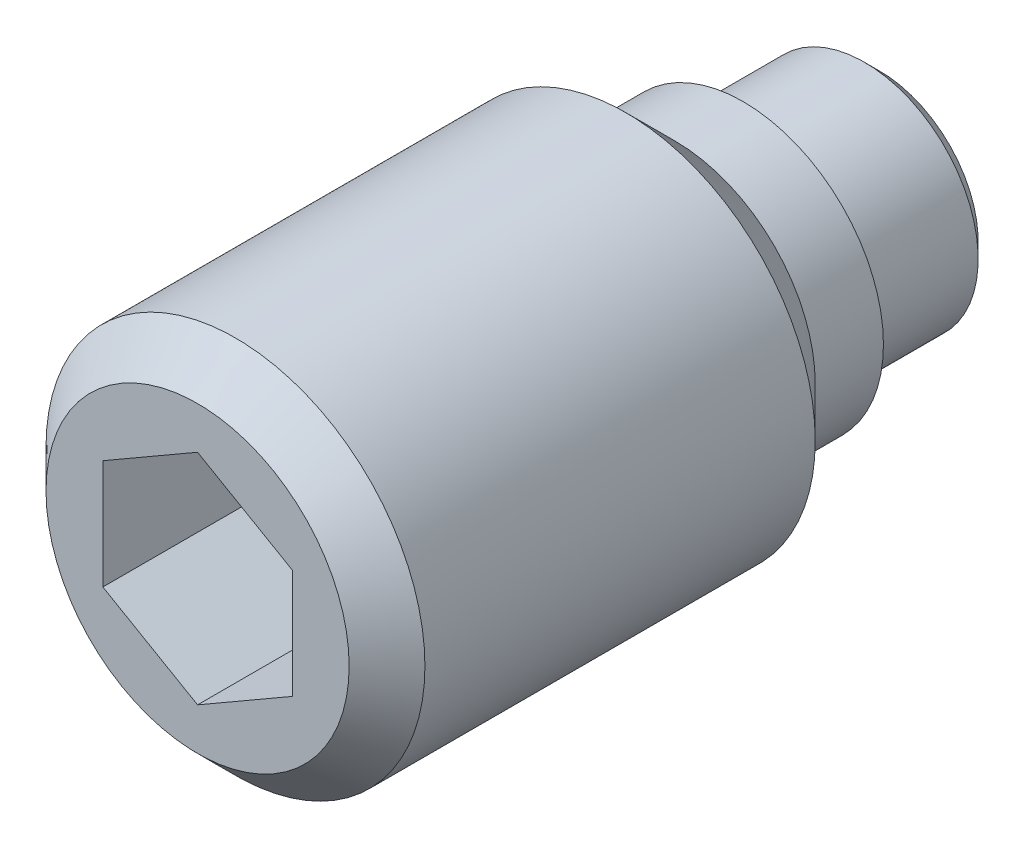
ISO-10303-21;
HEADER;
FILE_DESCRIPTION(('STEP AP214'),'2;1');
FILE_NAME('part.step','',(''),(''),'','','');
FILE_SCHEMA(('AUTOMOTIVE_DESIGN { 1 0 10303 214 1 1 1 1 }'));
ENDSEC;
DATA;
#1=APPLICATION_CONTEXT('core data for automotive mechanical design processes');
#2=APPLICATION_PROTOCOL_DEFINITION('international standard','automotive_design',2000,#1);
#3=PRODUCT_CONTEXT('',#1,'mechanical');
#4=PRODUCT('Part','Part','',(#3));
#5=PRODUCT_RELATED_PRODUCT_CATEGORY('part','',(#4));
#6=PRODUCT_DEFINITION_FORMATION('','',#4);
#7=PRODUCT_DEFINITION_CONTEXT('part definition',#1,'design');
#8=PRODUCT_DEFINITION('design','',#6,#7);
#9=PRODUCT_DEFINITION_SHAPE('','',#8);
#10=(LENGTH_UNIT() NAMED_UNIT(*) SI_UNIT(.MILLI.,.METRE.));
#11=(NAMED_UNIT(*) PLANE_ANGLE_UNIT() SI_UNIT($,.RADIAN.));
#12=(NAMED_UNIT(*) SI_UNIT($,.STERADIAN.) SOLID_ANGLE_UNIT());
#13=UNCERTAINTY_MEASURE_WITH_UNIT(LENGTH_MEASURE(1.E-05),#10,'distance_accuracy_value','');
#14=(GEOMETRIC_REPRESENTATION_CONTEXT(3) GLOBAL_UNCERTAINTY_ASSIGNED_CONTEXT((#13)) GLOBAL_UNIT_ASSIGNED_CONTEXT((#10,
#11,#12)) REPRESENTATION_CONTEXT('',''));
#15=CARTESIAN_POINT('',(0.,0.,0.));
#16=DIRECTION('',(0.,0.,1.));
#17=DIRECTION('',(1.,0.,0.));
#18=AXIS2_PLACEMENT_3D('',#15,#16,#17);
#19=CARTESIAN_POINT('',(0.,0.,1.8));
#20=DIRECTION('',(0.,0.,-1.));
#21=DIRECTION('',(-1.,0.,0.));
#22=AXIS2_PLACEMENT_3D('',#19,#20,#21);
#23=CYLINDRICAL_SURFACE('',#22,2.5);
#24=CARTESIAN_POINT('',(0.,0.,3.35));
#25=DIRECTION('',(0.,0.,-1.));
#26=DIRECTION('',(-1.,0.,0.));
#27=AXIS2_PLACEMENT_3D('',#24,#25,#26);
#28=CIRCLE('',#27,2.5);
#29=CARTESIAN_POINT('',(-2.5,0.,3.35));
#30=VERTEX_POINT('',#29);
#31=EDGE_CURVE('E9',#30,#30,#28,.T.);
#32=ORIENTED_EDGE('',*,*,#31,.F.);
#33=EDGE_LOOP('',(#32));
#34=FACE_BOUND('',#33,.T.);
#35=CARTESIAN_POINT('',(0.,0.,8.5));
#36=DIRECTION('',(0.,0.,1.));
#37=DIRECTION('',(1.,0.,0.));
#38=AXIS2_PLACEMENT_3D('',#35,#36,#37);
#39=CIRCLE('',#38,2.5);
#40=CARTESIAN_POINT('',(2.5,0.,8.5));
#41=VERTEX_POINT('',#40);
#42=EDGE_CURVE('E123',#41,#41,#39,.T.);
#43=ORIENTED_EDGE('',*,*,#42,.F.);
#44=EDGE_LOOP('',(#43));
#45=FACE_BOUND('',#44,.T.);
#46=ADVANCED_FACE('F14',(#34,#45),#23,.T.);
#47=CARTESIAN_POINT('',(0.,0.,3.35));
#48=DIRECTION('',(0.,0.,1.));
#49=DIRECTION('',(1.,0.,0.));
#50=AXIS2_PLACEMENT_3D('',#47,#48,#49);
#51=CONICAL_SURFACE('',#50,2.5,0.785398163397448);
#52=ORIENTED_EDGE('',*,*,#31,.T.);
#53=EDGE_LOOP('',(#52));
#54=FACE_BOUND('',#53,.T.);
#55=CARTESIAN_POINT('',(0.,0.,2.7));
#56=DIRECTION('',(0.,0.,-1.));
#57=DIRECTION('',(-1.,0.,0.));
#58=AXIS2_PLACEMENT_3D('',#55,#56,#57);
#59=CIRCLE('',#58,1.85);
#60=CARTESIAN_POINT('',(-1.85,0.,2.7));
#61=VERTEX_POINT('',#60);
#62=EDGE_CURVE('E21',#61,#61,#59,.T.);
#63=ORIENTED_EDGE('',*,*,#62,.F.);
#64=EDGE_LOOP('',(#63));
#65=FACE_BOUND('',#64,.T.);
#66=ADVANCED_FACE('F143',(#54,#65),#51,.T.);
#67=CARTESIAN_POINT('',(0.,0.,1.8));
#68=DIRECTION('',(0.,0.,-1.));
#69=DIRECTION('',(-1.,0.,0.));
#70=AXIS2_PLACEMENT_3D('',#67,#68,#69);
#71=CYLINDRICAL_SURFACE('',#70,1.85);
#72=ORIENTED_EDGE('',*,*,#62,.T.);
#73=EDGE_LOOP('',(#72));
#74=FACE_BOUND('',#73,.T.);
#75=CARTESIAN_POINT('',(0.,0.,1.8));
#76=DIRECTION('',(0.,0.,-1.));
#77=DIRECTION('',(-1.,0.,0.));
#78=AXIS2_PLACEMENT_3D('',#75,#76,#77);
#79=CIRCLE('',#78,1.85);
#80=CARTESIAN_POINT('',(-1.85,0.,1.8));
#81=VERTEX_POINT('',#80);
#82=EDGE_CURVE('E135',#81,#81,#79,.T.);
#83=ORIENTED_EDGE('',*,*,#82,.F.);
#84=EDGE_LOOP('',(#83));
#85=FACE_BOUND('',#84,.T.);
#86=ADVANCED_FACE('F140',(#74,#85),#71,.T.);
#87=CARTESIAN_POINT('',(0.,1.85,1.8));
#88=DIRECTION('',(0.,0.,1.));
#89=DIRECTION('',(1.,0.,0.));
#90=AXIS2_PLACEMENT_3D('',#87,#88,#89);
#91=PLANE('',#90);
#92=ORIENTED_EDGE('',*,*,#82,.T.);
#93=EDGE_LOOP('',(#92));
#94=FACE_BOUND('',#93,.T.);
#95=CARTESIAN_POINT('',(0.,0.,1.8));
#96=DIRECTION('',(0.,0.,-1.));
#97=DIRECTION('',(-1.,0.,0.));
#98=AXIS2_PLACEMENT_3D('',#95,#96,#97);
#99=CIRCLE('',#98,1.5);
#100=CARTESIAN_POINT('',(-1.5,0.,1.8));
#101=VERTEX_POINT('',#100);
#102=EDGE_CURVE('E132',#101,#101,#99,.T.);
#103=ORIENTED_EDGE('',*,*,#102,.F.);
#104=EDGE_LOOP('',(#103));
#105=FACE_BOUND('',#104,.T.);
#106=ADVANCED_FACE('F151',(#94,#105),#91,.F.);
#107=CARTESIAN_POINT('',(0.,0.,0.));
#108=DIRECTION('',(0.,0.,-1.));
#109=DIRECTION('',(-1.,0.,0.));
#110=AXIS2_PLACEMENT_3D('',#107,#108,#109);
#111=CYLINDRICAL_SURFACE('',#110,1.5);
#112=CARTESIAN_POINT('',(0.,0.,0.2));
#113=DIRECTION('',(0.,0.,-1.));
#114=DIRECTION('',(-1.,0.,0.));
#115=AXIS2_PLACEMENT_3D('',#112,#113,#114);
#116=CIRCLE('',#115,1.5);
#117=CARTESIAN_POINT('',(-1.5,0.,0.2));
#118=VERTEX_POINT('',#117);
#119=EDGE_CURVE('E129',#118,#118,#116,.T.);
#120=ORIENTED_EDGE('',*,*,#119,.F.);
#121=EDGE_LOOP('',(#120));
#122=FACE_BOUND('',#121,.T.);
#123=ORIENTED_EDGE('',*,*,#102,.T.);
#124=EDGE_LOOP('',(#123));
#125=FACE_BOUND('',#124,.T.);
#126=ADVANCED_FACE('F157',(#122,#125),#111,.T.);
#127=CARTESIAN_POINT('',(0.,0.,0.2));
#128=DIRECTION('',(0.,0.,1.));
#129=DIRECTION('',(1.,0.,0.));
#130=AXIS2_PLACEMENT_3D('',#127,#128,#129);
#131=CONICAL_SURFACE('',#130,1.5,0.785398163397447);
#132=CARTESIAN_POINT('',(0.,0.,0.));
#133=DIRECTION('',(0.,0.,-1.));
#134=DIRECTION('',(-1.,0.,0.));
#135=AXIS2_PLACEMENT_3D('',#132,#133,#134);
#136=CIRCLE('',#135,1.3);
#137=CARTESIAN_POINT('',(-1.3,0.,0.));
#138=VERTEX_POINT('',#137);
#139=EDGE_CURVE('E126',#138,#138,#136,.T.);
#140=ORIENTED_EDGE('',*,*,#139,.F.);
#141=EDGE_LOOP('',(#140));
#142=FACE_BOUND('',#141,.T.);
#143=ORIENTED_EDGE('',*,*,#119,.T.);
#144=EDGE_LOOP('',(#143));
#145=FACE_BOUND('',#144,.T.);
#146=ADVANCED_FACE('F161',(#142,#145),#131,.T.);
#147=CARTESIAN_POINT('',(0.,1.3,0.));
#148=DIRECTION('',(0.,0.,1.));
#149=DIRECTION('',(1.,0.,0.));
#150=AXIS2_PLACEMENT_3D('',#147,#148,#149);
#151=PLANE('',#150);
#152=ORIENTED_EDGE('',*,*,#139,.T.);
#153=EDGE_LOOP('',(#152));
#154=FACE_BOUND('',#153,.T.);
#155=ADVANCED_FACE('F165',(#154),#151,.F.);
#156=CARTESIAN_POINT('',(0.,0.,9.));
#157=DIRECTION('',(0.,0.,-1.));
#158=DIRECTION('',(-1.,0.,0.));
#159=AXIS2_PLACEMENT_3D('',#156,#157,#158);
#160=CONICAL_SURFACE('',#159,2.,0.785398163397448);
#161=ORIENTED_EDGE('',*,*,#42,.T.);
#162=EDGE_LOOP('',(#161));
#163=FACE_BOUND('',#162,.T.);
#164=CARTESIAN_POINT('',(0.,0.,9.));
#165=DIRECTION('',(0.,0.,1.));
#166=DIRECTION('',(1.,0.,0.));
#167=AXIS2_PLACEMENT_3D('',#164,#165,#166);
#168=CIRCLE('',#167,2.);
#169=CARTESIAN_POINT('',(2.,0.,9.));
#170=VERTEX_POINT('',#169);
#171=EDGE_CURVE('E115',#170,#170,#168,.T.);
#172=ORIENTED_EDGE('',*,*,#171,.F.);
#173=EDGE_LOOP('',(#172));
#174=FACE_BOUND('',#173,.T.);
#175=ADVANCED_FACE('F169',(#163,#174),#160,.T.);
#176=CARTESIAN_POINT('',(0.,-2.,9.));
#177=DIRECTION('',(0.,0.,1.));
#178=DIRECTION('',(1.,0.,0.));
#179=AXIS2_PLACEMENT_3D('',#176,#177,#178);
#180=PLANE('',#179);
#181=DIRECTION('',(0.866025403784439,-0.5,0.));
#182=VECTOR('',#181,1.);
#183=CARTESIAN_POINT('',(-1.25,-0.721687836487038,9.));
#184=LINE('',#183,#182);
#185=CARTESIAN_POINT('',(-1.25,-0.721687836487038,9.));
#186=VERTEX_POINT('',#185);
#187=CARTESIAN_POINT('',(0.,-1.44337567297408,9.));
#188=VERTEX_POINT('',#187);
#189=EDGE_CURVE('E28',#186,#188,#184,.T.);
#190=ORIENTED_EDGE('',*,*,#189,.F.);
#191=DIRECTION('',(0.,-1.,0.));
#192=VECTOR('',#191,1.);
#193=CARTESIAN_POINT('',(-1.25,0.721687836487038,9.));
#194=LINE('',#193,#192);
#195=CARTESIAN_POINT('',(-1.25,0.721687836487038,9.));
#196=VERTEX_POINT('',#195);
#197=EDGE_CURVE('E111',#196,#186,#194,.T.);
#198=ORIENTED_EDGE('',*,*,#197,.F.);
#199=DIRECTION('',(-0.866025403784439,-0.5,0.));
#200=VECTOR('',#199,1.);
#201=CARTESIAN_POINT('',(0.,1.44337567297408,9.));
#202=LINE('',#201,#200);
#203=CARTESIAN_POINT('',(0.,1.44337567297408,9.));
#204=VERTEX_POINT('',#203);
#205=EDGE_CURVE('E109',#204,#196,#202,.T.);
#206=ORIENTED_EDGE('',*,*,#205,.F.);
#207=DIRECTION('',(-0.866025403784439,0.5,0.));
#208=VECTOR('',#207,1.);
#209=CARTESIAN_POINT('',(1.25,0.721687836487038,9.));
#210=LINE('',#209,#208);
#211=CARTESIAN_POINT('',(1.25,0.721687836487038,9.));
#212=VERTEX_POINT('',#211);
#213=EDGE_CURVE('E76',#212,#204,#210,.T.);
#214=ORIENTED_EDGE('',*,*,#213,.F.);
#215=DIRECTION('',(0.,1.,0.));
#216=VECTOR('',#215,1.);
#217=CARTESIAN_POINT('',(1.25,-0.721687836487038,9.));
#218=LINE('',#217,#216);
#219=CARTESIAN_POINT('',(1.25,-0.721687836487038,9.));
#220=VERTEX_POINT('',#219);
#221=EDGE_CURVE('E105',#220,#212,#218,.T.);
#222=ORIENTED_EDGE('',*,*,#221,.F.);
#223=DIRECTION('',(0.866025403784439,0.5,0.));
#224=VECTOR('',#223,1.);
#225=CARTESIAN_POINT('',(0.,-1.44337567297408,9.));
#226=LINE('',#225,#224);
#227=EDGE_CURVE('E102',#188,#220,#226,.T.);
#228=ORIENTED_EDGE('',*,*,#227,.F.);
#229=EDGE_LOOP('',(#190,#198,#206,#214,#222,#228));
#230=FACE_BOUND('',#229,.T.);
#231=ORIENTED_EDGE('',*,*,#171,.T.);
#232=EDGE_LOOP('',(#231));
#233=FACE_BOUND('',#232,.T.);
#234=ADVANCED_FACE('F173',(#230,#233),#180,.T.);
#235=CARTESIAN_POINT('',(-1.25,-0.721687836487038,6.));
#236=DIRECTION('',(-0.5,-0.866025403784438,0.));
#237=DIRECTION('',(0.866025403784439,-0.5,0.));
#238=AXIS2_PLACEMENT_3D('',#235,#236,#237);
#239=PLANE('',#238);
#240=ORIENTED_EDGE('',*,*,#189,.T.);
#241=DIRECTION('',(0.,0.,1.));
#242=VECTOR('',#241,1.);
#243=CARTESIAN_POINT('',(0.,-1.44337567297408,6.));
#244=LINE('',#243,#242);
#245=CARTESIAN_POINT('',(0.,-1.44337567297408,6.));
#246=VERTEX_POINT('',#245);
#247=EDGE_CURVE('E58',#246,#188,#244,.T.);
#248=ORIENTED_EDGE('',*,*,#247,.F.);
#249=DIRECTION('',(0.866025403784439,-0.5,0.));
#250=VECTOR('',#249,1.);
#251=CARTESIAN_POINT('',(-1.25,-0.721687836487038,6.));
#252=LINE('',#251,#250);
#253=CARTESIAN_POINT('',(-1.25,-0.721687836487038,6.));
#254=VERTEX_POINT('',#253);
#255=EDGE_CURVE('E113',#254,#246,#252,.T.);
#256=ORIENTED_EDGE('',*,*,#255,.F.);
#257=DIRECTION('',(0.,0.,1.));
#258=VECTOR('',#257,1.);
#259=CARTESIAN_POINT('',(-1.25,-0.721687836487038,6.));
#260=LINE('',#259,#258);
#261=EDGE_CURVE('E36',#254,#186,#260,.T.);
#262=ORIENTED_EDGE('',*,*,#261,.T.);
#263=EDGE_LOOP('',(#240,#248,#256,#262));
#264=FACE_BOUND('',#263,.T.);
#265=ADVANCED_FACE('F177',(#264),#239,.F.);
#266=CARTESIAN_POINT('',(-1.25,0.721687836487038,6.));
#267=DIRECTION('',(-1.,0.,0.));
#268=DIRECTION('',(0.,0.,1.));
#269=AXIS2_PLACEMENT_3D('',#266,#267,#268);
#270=PLANE('',#269);
#271=ORIENTED_EDGE('',*,*,#197,.T.);
#272=ORIENTED_EDGE('',*,*,#261,.F.);
#273=DIRECTION('',(0.,-1.,0.));
#274=VECTOR('',#273,1.);
#275=CARTESIAN_POINT('',(-1.25,0.721687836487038,6.));
#276=LINE('',#275,#274);
#277=CARTESIAN_POINT('',(-1.25,0.721687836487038,6.));
#278=VERTEX_POINT('',#277);
#279=EDGE_CURVE('E88',#278,#254,#276,.T.);
#280=ORIENTED_EDGE('',*,*,#279,.F.);
#281=DIRECTION('',(0.,0.,1.));
#282=VECTOR('',#281,1.);
#283=CARTESIAN_POINT('',(-1.25,0.721687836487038,6.));
#284=LINE('',#283,#282);
#285=EDGE_CURVE('E80',#278,#196,#284,.T.);
#286=ORIENTED_EDGE('',*,*,#285,.T.);
#287=EDGE_LOOP('',(#271,#272,#280,#286));
#288=FACE_BOUND('',#287,.T.);
#289=ADVANCED_FACE('F181',(#288),#270,.F.);
#290=CARTESIAN_POINT('',(0.,1.44337567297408,6.));
#291=DIRECTION('',(-0.5,0.866025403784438,0.));
#292=DIRECTION('',(-0.866025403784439,-0.5,0.));
#293=AXIS2_PLACEMENT_3D('',#290,#291,#292);
#294=PLANE('',#293);
#295=ORIENTED_EDGE('',*,*,#205,.T.);
#296=ORIENTED_EDGE('',*,*,#285,.F.);
#297=DIRECTION('',(-0.866025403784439,-0.5,0.));
#298=VECTOR('',#297,1.);
#299=CARTESIAN_POINT('',(0.,1.44337567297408,6.));
#300=LINE('',#299,#298);
#301=CARTESIAN_POINT('',(0.,1.44337567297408,6.));
#302=VERTEX_POINT('',#301);
#303=EDGE_CURVE('E84',#302,#278,#300,.T.);
#304=ORIENTED_EDGE('',*,*,#303,.F.);
#305=DIRECTION('',(0.,0.,1.));
#306=VECTOR('',#305,1.);
#307=CARTESIAN_POINT('',(0.,1.44337567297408,6.));
#308=LINE('',#307,#306);
#309=EDGE_CURVE('E69',#302,#204,#308,.T.);
#310=ORIENTED_EDGE('',*,*,#309,.T.);
#311=EDGE_LOOP('',(#295,#296,#304,#310));
#312=FACE_BOUND('',#311,.T.);
#313=ADVANCED_FACE('F85',(#312),#294,.F.);
#314=CARTESIAN_POINT('',(1.25,0.721687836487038,6.));
#315=DIRECTION('',(0.5,0.866025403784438,0.));
#316=DIRECTION('',(-0.866025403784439,0.5,0.));
#317=AXIS2_PLACEMENT_3D('',#314,#315,#316);
#318=PLANE('',#317);
#319=ORIENTED_EDGE('',*,*,#213,.T.);
#320=ORIENTED_EDGE('',*,*,#309,.F.);
#321=DIRECTION('',(-0.866025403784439,0.5,0.));
#322=VECTOR('',#321,1.);
#323=CARTESIAN_POINT('',(1.25,0.721687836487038,6.));
#324=LINE('',#323,#322);
#325=CARTESIAN_POINT('',(1.25,0.721687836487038,6.));
#326=VERTEX_POINT('',#325);
#327=EDGE_CURVE('E73',#326,#302,#324,.T.);
#328=ORIENTED_EDGE('',*,*,#327,.F.);
#329=DIRECTION('',(0.,0.,1.));
#330=VECTOR('',#329,1.);
#331=CARTESIAN_POINT('',(1.25,0.721687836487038,6.));
#332=LINE('',#331,#330);
#333=EDGE_CURVE('E81',#326,#212,#332,.T.);
#334=ORIENTED_EDGE('',*,*,#333,.T.);
#335=EDGE_LOOP('',(#319,#320,#328,#334));
#336=FACE_BOUND('',#335,.T.);
#337=ADVANCED_FACE('F71',(#336),#318,.F.);
#338=CARTESIAN_POINT('',(1.25,-0.721687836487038,6.));
#339=DIRECTION('',(1.,0.,0.));
#340=DIRECTION('',(0.,0.,-1.));
#341=AXIS2_PLACEMENT_3D('',#338,#339,#340);
#342=PLANE('',#341);
#343=ORIENTED_EDGE('',*,*,#221,.T.);
#344=ORIENTED_EDGE('',*,*,#333,.F.);
#345=DIRECTION('',(0.,1.,0.));
#346=VECTOR('',#345,1.);
#347=CARTESIAN_POINT('',(1.25,-0.721687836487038,6.));
#348=LINE('',#347,#346);
#349=CARTESIAN_POINT('',(1.25,-0.721687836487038,6.));
#350=VERTEX_POINT('',#349);
#351=EDGE_CURVE('E94',#350,#326,#348,.T.);
#352=ORIENTED_EDGE('',*,*,#351,.F.);
#353=DIRECTION('',(0.,0.,1.));
#354=VECTOR('',#353,1.);
#355=CARTESIAN_POINT('',(1.25,-0.721687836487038,6.));
#356=LINE('',#355,#354);
#357=EDGE_CURVE('E118',#350,#220,#356,.T.);
#358=ORIENTED_EDGE('',*,*,#357,.T.);
#359=EDGE_LOOP('',(#343,#344,#352,#358));
#360=FACE_BOUND('',#359,.T.);
#361=ADVANCED_FACE('F185',(#360),#342,.F.);
#362=CARTESIAN_POINT('',(0.,-1.44337567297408,6.));
#363=DIRECTION('',(0.5,-0.866025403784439,0.));
#364=DIRECTION('',(0.866025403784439,0.5,0.));
#365=AXIS2_PLACEMENT_3D('',#362,#363,#364);
#366=PLANE('',#365);
#367=ORIENTED_EDGE('',*,*,#227,.T.);
#368=ORIENTED_EDGE('',*,*,#357,.F.);
#369=DIRECTION('',(0.866025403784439,0.5,0.));
#370=VECTOR('',#369,1.);
#371=CARTESIAN_POINT('',(0.,-1.44337567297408,6.));
#372=LINE('',#371,#370);
#373=EDGE_CURVE('E96',#246,#350,#372,.T.);
#374=ORIENTED_EDGE('',*,*,#373,.F.);
#375=ORIENTED_EDGE('',*,*,#247,.T.);
#376=EDGE_LOOP('',(#367,#368,#374,#375));
#377=FACE_BOUND('',#376,.T.);
#378=ADVANCED_FACE('F182',(#377),#366,.F.);
#379=CARTESIAN_POINT('',(0.,0.,6.));
#380=DIRECTION('',(0.,0.,1.));
#381=DIRECTION('',(1.,0.,0.));
#382=AXIS2_PLACEMENT_3D('',#379,#380,#381);
#383=PLANE('',#382);
#384=ORIENTED_EDGE('',*,*,#255,.T.);
#385=ORIENTED_EDGE('',*,*,#373,.T.);
#386=ORIENTED_EDGE('',*,*,#351,.T.);
#387=ORIENTED_EDGE('',*,*,#327,.T.);
#388=ORIENTED_EDGE('',*,*,#303,.T.);
#389=ORIENTED_EDGE('',*,*,#279,.T.);
#390=EDGE_LOOP('',(#384,#385,#386,#387,#388,#389));
#391=FACE_BOUND('',#390,.T.);
#392=ADVANCED_FACE('F91',(#391),#383,.T.);
#393=CLOSED_SHELL('',(#46,#66,#86,#106,#126,#146,#155,#175,#234,#265,#289,#313,#337,#361,#378,#392));
#394=MANIFOLD_SOLID_BREP('B1',#393);
#395=ADVANCED_BREP_SHAPE_REPRESENTATION('',(#18,#394),#14);
#396=SHAPE_DEFINITION_REPRESENTATION(#9,#395);
ENDSEC;
END-ISO-10303-21;
